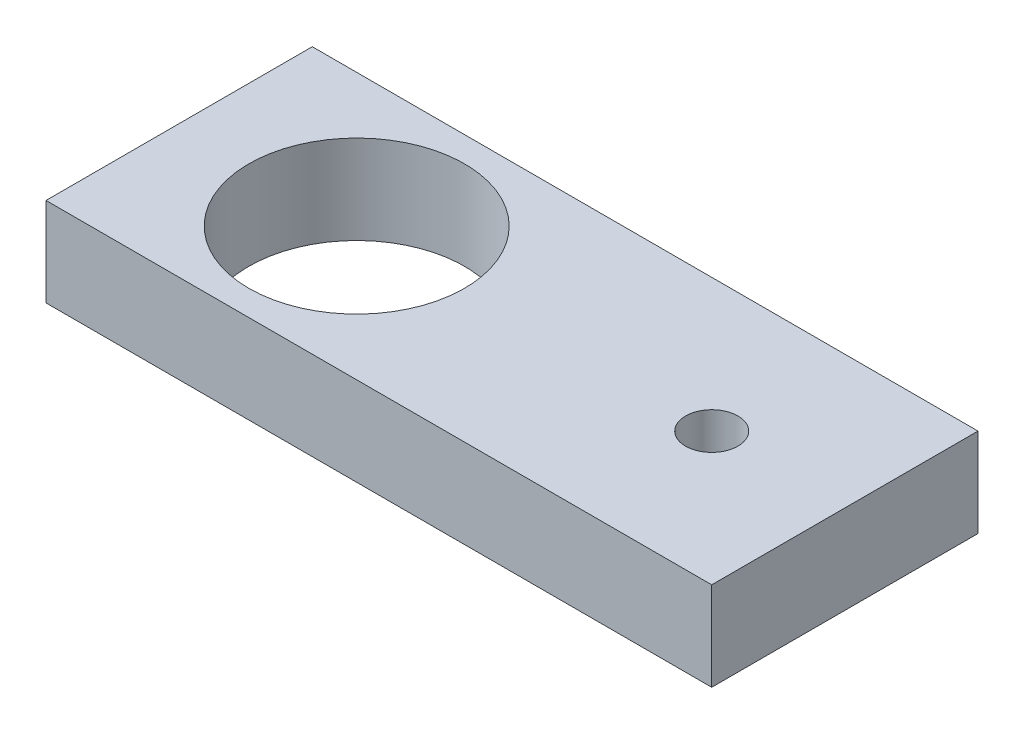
ISO-10303-21;
HEADER;
FILE_DESCRIPTION(('STEP AP214'),'2;1');
FILE_NAME('part.step','',(''),(''),'','','');
FILE_SCHEMA(('AUTOMOTIVE_DESIGN { 1 0 10303 214 1 1 1 1 }'));
ENDSEC;
DATA;
#1=APPLICATION_CONTEXT('core data for automotive mechanical design processes');
#2=APPLICATION_PROTOCOL_DEFINITION('international standard','automotive_design',2000,#1);
#3=PRODUCT_CONTEXT('',#1,'mechanical');
#4=PRODUCT('Part','Part','',(#3));
#5=PRODUCT_RELATED_PRODUCT_CATEGORY('part','',(#4));
#6=PRODUCT_DEFINITION_FORMATION('','',#4);
#7=PRODUCT_DEFINITION_CONTEXT('part definition',#1,'design');
#8=PRODUCT_DEFINITION('design','',#6,#7);
#9=PRODUCT_DEFINITION_SHAPE('','',#8);
#10=(LENGTH_UNIT() NAMED_UNIT(*) SI_UNIT(.MILLI.,.METRE.));
#11=(NAMED_UNIT(*) PLANE_ANGLE_UNIT() SI_UNIT($,.RADIAN.));
#12=(NAMED_UNIT(*) SI_UNIT($,.STERADIAN.) SOLID_ANGLE_UNIT());
#13=UNCERTAINTY_MEASURE_WITH_UNIT(LENGTH_MEASURE(1.E-05),#10,'distance_accuracy_value','');
#14=(GEOMETRIC_REPRESENTATION_CONTEXT(3) GLOBAL_UNCERTAINTY_ASSIGNED_CONTEXT((#13)) GLOBAL_UNIT_ASSIGNED_CONTEXT((#10,
#11,#12)) REPRESENTATION_CONTEXT('',''));
#15=CARTESIAN_POINT('',(0.,0.,0.));
#16=DIRECTION('',(0.,0.,1.));
#17=DIRECTION('',(1.,0.,0.));
#18=AXIS2_PLACEMENT_3D('',#15,#16,#17);
#19=CARTESIAN_POINT('',(0.,2.,0.));
#20=DIRECTION('',(1.,0.,0.));
#21=DIRECTION('',(0.,0.,-1.));
#22=AXIS2_PLACEMENT_3D('',#19,#20,#21);
#23=PLANE('',#22);
#24=DIRECTION('',(0.,0.,1.));
#25=VECTOR('',#24,1.);
#26=CARTESIAN_POINT('',(0.,0.,0.));
#27=LINE('',#26,#25);
#28=CARTESIAN_POINT('',(0.,0.,0.));
#29=VERTEX_POINT('',#28);
#30=CARTESIAN_POINT('',(0.,0.,6.));
#31=VERTEX_POINT('',#30);
#32=EDGE_CURVE('E114',#29,#31,#27,.T.);
#33=ORIENTED_EDGE('',*,*,#32,.T.);
#34=DIRECTION('',(0.,-1.,0.));
#35=VECTOR('',#34,1.);
#36=CARTESIAN_POINT('',(0.,2.,6.));
#37=LINE('',#36,#35);
#38=CARTESIAN_POINT('',(0.,2.,6.));
#39=VERTEX_POINT('',#38);
#40=EDGE_CURVE('E11',#39,#31,#37,.T.);
#41=ORIENTED_EDGE('',*,*,#40,.F.);
#42=DIRECTION('',(0.,0.,1.));
#43=VECTOR('',#42,1.);
#44=CARTESIAN_POINT('',(0.,2.,0.));
#45=LINE('',#44,#43);
#46=CARTESIAN_POINT('',(0.,2.,0.));
#47=VERTEX_POINT('',#46);
#48=EDGE_CURVE('E100',#47,#39,#45,.T.);
#49=ORIENTED_EDGE('',*,*,#48,.F.);
#50=DIRECTION('',(0.,-1.,0.));
#51=VECTOR('',#50,1.);
#52=CARTESIAN_POINT('',(0.,2.,0.));
#53=LINE('',#52,#51);
#54=EDGE_CURVE('E108',#47,#29,#53,.T.);
#55=ORIENTED_EDGE('',*,*,#54,.T.);
#56=EDGE_LOOP('',(#33,#41,#49,#55));
#57=FACE_BOUND('',#56,.T.);
#58=ADVANCED_FACE('F44',(#57),#23,.F.);
#59=CARTESIAN_POINT('',(0.,2.,6.));
#60=DIRECTION('',(0.,0.,-1.));
#61=DIRECTION('',(-1.,0.,0.));
#62=AXIS2_PLACEMENT_3D('',#59,#60,#61);
#63=PLANE('',#62);
#64=DIRECTION('',(1.,0.,0.));
#65=VECTOR('',#64,1.);
#66=CARTESIAN_POINT('',(0.,0.,6.));
#67=LINE('',#66,#65);
#68=CARTESIAN_POINT('',(15.,0.,6.));
#69=VERTEX_POINT('',#68);
#70=EDGE_CURVE('E105',#31,#69,#67,.T.);
#71=ORIENTED_EDGE('',*,*,#70,.T.);
#72=DIRECTION('',(0.,-1.,0.));
#73=VECTOR('',#72,1.);
#74=CARTESIAN_POINT('',(15.,2.,6.));
#75=LINE('',#74,#73);
#76=CARTESIAN_POINT('',(15.,2.,6.));
#77=VERTEX_POINT('',#76);
#78=EDGE_CURVE('E53',#77,#69,#75,.T.);
#79=ORIENTED_EDGE('',*,*,#78,.F.);
#80=DIRECTION('',(1.,0.,0.));
#81=VECTOR('',#80,1.);
#82=CARTESIAN_POINT('',(0.,2.,6.));
#83=LINE('',#82,#81);
#84=EDGE_CURVE('E95',#39,#77,#83,.T.);
#85=ORIENTED_EDGE('',*,*,#84,.F.);
#86=ORIENTED_EDGE('',*,*,#40,.T.);
#87=EDGE_LOOP('',(#71,#79,#85,#86));
#88=FACE_BOUND('',#87,.T.);
#89=ADVANCED_FACE('F101',(#88),#63,.F.);
#90=CARTESIAN_POINT('',(15.,2.,0.));
#91=DIRECTION('',(-1.,0.,0.));
#92=DIRECTION('',(0.,0.,1.));
#93=AXIS2_PLACEMENT_3D('',#90,#91,#92);
#94=PLANE('',#93);
#95=DIRECTION('',(0.,0.,-1.));
#96=VECTOR('',#95,1.);
#97=CARTESIAN_POINT('',(15.,0.,0.));
#98=LINE('',#97,#96);
#99=CARTESIAN_POINT('',(15.,0.,0.));
#100=VERTEX_POINT('',#99);
#101=EDGE_CURVE('E78',#69,#100,#98,.T.);
#102=ORIENTED_EDGE('',*,*,#101,.T.);
#103=DIRECTION('',(0.,-1.,0.));
#104=VECTOR('',#103,1.);
#105=CARTESIAN_POINT('',(15.,2.,0.));
#106=LINE('',#105,#104);
#107=CARTESIAN_POINT('',(15.,2.,0.));
#108=VERTEX_POINT('',#107);
#109=EDGE_CURVE('E102',#108,#100,#106,.T.);
#110=ORIENTED_EDGE('',*,*,#109,.F.);
#111=DIRECTION('',(0.,0.,-1.));
#112=VECTOR('',#111,1.);
#113=CARTESIAN_POINT('',(15.,2.,0.));
#114=LINE('',#113,#112);
#115=EDGE_CURVE('E92',#77,#108,#114,.T.);
#116=ORIENTED_EDGE('',*,*,#115,.F.);
#117=ORIENTED_EDGE('',*,*,#78,.T.);
#118=EDGE_LOOP('',(#102,#110,#116,#117));
#119=FACE_BOUND('',#118,.T.);
#120=ADVANCED_FACE('F104',(#119),#94,.F.);
#121=CARTESIAN_POINT('',(0.,2.,0.));
#122=DIRECTION('',(0.,0.,1.));
#123=DIRECTION('',(1.,0.,0.));
#124=AXIS2_PLACEMENT_3D('',#121,#122,#123);
#125=PLANE('',#124);
#126=DIRECTION('',(-1.,0.,0.));
#127=VECTOR('',#126,1.);
#128=CARTESIAN_POINT('',(0.,0.,0.));
#129=LINE('',#128,#127);
#130=EDGE_CURVE('E84',#100,#29,#129,.T.);
#131=ORIENTED_EDGE('',*,*,#130,.T.);
#132=ORIENTED_EDGE('',*,*,#54,.F.);
#133=DIRECTION('',(-1.,0.,0.));
#134=VECTOR('',#133,1.);
#135=CARTESIAN_POINT('',(0.,2.,0.));
#136=LINE('',#135,#134);
#137=EDGE_CURVE('E65',#108,#47,#136,.T.);
#138=ORIENTED_EDGE('',*,*,#137,.F.);
#139=ORIENTED_EDGE('',*,*,#109,.T.);
#140=EDGE_LOOP('',(#131,#132,#138,#139));
#141=FACE_BOUND('',#140,.T.);
#142=ADVANCED_FACE('F130',(#141),#125,.F.);
#143=CARTESIAN_POINT('',(0.,2.,0.));
#144=DIRECTION('',(0.,1.,0.));
#145=DIRECTION('',(0.,0.,1.));
#146=AXIS2_PLACEMENT_3D('',#143,#144,#145);
#147=PLANE('',#146);
#148=CARTESIAN_POINT('',(4.00000000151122,2.,2.99999818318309));
#149=DIRECTION('',(0.,1.,0.));
#150=DIRECTION('',(0.,0.,1.));
#151=AXIS2_PLACEMENT_3D('',#148,#149,#150);
#152=CIRCLE('',#151,2.43);
#153=CARTESIAN_POINT('',(4.00000000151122,2.,5.42999818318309));
#154=VERTEX_POINT('',#153);
#155=EDGE_CURVE('E142',#154,#154,#152,.T.);
#156=ORIENTED_EDGE('',*,*,#155,.F.);
#157=EDGE_LOOP('',(#156));
#158=FACE_BOUND('',#157,.T.);
#159=CARTESIAN_POINT('',(12.,2.,2.99984268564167));
#160=DIRECTION('',(0.,1.,0.));
#161=DIRECTION('',(0.,0.,1.));
#162=AXIS2_PLACEMENT_3D('',#159,#160,#161);
#163=CIRCLE('',#162,0.590071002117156);
#164=CARTESIAN_POINT('',(12.,2.,3.58991368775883));
#165=VERTEX_POINT('',#164);
#166=EDGE_CURVE('E138',#165,#165,#163,.T.);
#167=ORIENTED_EDGE('',*,*,#166,.F.);
#168=EDGE_LOOP('',(#167));
#169=FACE_BOUND('',#168,.T.);
#170=ORIENTED_EDGE('',*,*,#48,.T.);
#171=ORIENTED_EDGE('',*,*,#84,.T.);
#172=ORIENTED_EDGE('',*,*,#115,.T.);
#173=ORIENTED_EDGE('',*,*,#137,.T.);
#174=EDGE_LOOP('',(#170,#171,#172,#173));
#175=FACE_BOUND('',#174,.T.);
#176=ADVANCED_FACE('F91',(#158,#169,#175),#147,.T.);
#177=CARTESIAN_POINT('',(0.,0.,0.));
#178=DIRECTION('',(0.,1.,0.));
#179=DIRECTION('',(0.,0.,1.));
#180=AXIS2_PLACEMENT_3D('',#177,#178,#179);
#181=PLANE('',#180);
#182=CARTESIAN_POINT('',(4.00000000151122,0.,2.99999818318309));
#183=DIRECTION('',(0.,1.,0.));
#184=DIRECTION('',(0.,0.,1.));
#185=AXIS2_PLACEMENT_3D('',#182,#183,#184);
#186=CIRCLE('',#185,2.43);
#187=CARTESIAN_POINT('',(4.00000000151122,0.,5.42999818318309));
#188=VERTEX_POINT('',#187);
#189=EDGE_CURVE('E120',#188,#188,#186,.T.);
#190=ORIENTED_EDGE('',*,*,#189,.T.);
#191=EDGE_LOOP('',(#190));
#192=FACE_BOUND('',#191,.T.);
#193=CARTESIAN_POINT('',(12.,0.,2.99984268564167));
#194=DIRECTION('',(0.,1.,0.));
#195=DIRECTION('',(0.,0.,1.));
#196=AXIS2_PLACEMENT_3D('',#193,#194,#195);
#197=CIRCLE('',#196,0.590071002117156);
#198=CARTESIAN_POINT('',(12.,0.,3.58991368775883));
#199=VERTEX_POINT('',#198);
#200=EDGE_CURVE('E133',#199,#199,#197,.T.);
#201=ORIENTED_EDGE('',*,*,#200,.T.);
#202=EDGE_LOOP('',(#201));
#203=FACE_BOUND('',#202,.T.);
#204=ORIENTED_EDGE('',*,*,#32,.F.);
#205=ORIENTED_EDGE('',*,*,#130,.F.);
#206=ORIENTED_EDGE('',*,*,#101,.F.);
#207=ORIENTED_EDGE('',*,*,#70,.F.);
#208=EDGE_LOOP('',(#204,#205,#206,#207));
#209=FACE_BOUND('',#208,.T.);
#210=ADVANCED_FACE('F128',(#192,#203,#209),#181,.F.);
#211=CARTESIAN_POINT('',(12.,0.,2.99984268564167));
#212=DIRECTION('',(0.,1.,0.));
#213=DIRECTION('',(0.,0.,1.));
#214=AXIS2_PLACEMENT_3D('',#211,#212,#213);
#215=CYLINDRICAL_SURFACE('',#214,0.590071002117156);
#216=ORIENTED_EDGE('',*,*,#200,.F.);
#217=EDGE_LOOP('',(#216));
#218=FACE_BOUND('',#217,.T.);
#219=ORIENTED_EDGE('',*,*,#166,.T.);
#220=EDGE_LOOP('',(#219));
#221=FACE_BOUND('',#220,.T.);
#222=ADVANCED_FACE('F154',(#218,#221),#215,.F.);
#223=CARTESIAN_POINT('',(4.00000000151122,0.,2.99999818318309));
#224=DIRECTION('',(0.,1.,0.));
#225=DIRECTION('',(0.,0.,1.));
#226=AXIS2_PLACEMENT_3D('',#223,#224,#225);
#227=CYLINDRICAL_SURFACE('',#226,2.43);
#228=ORIENTED_EDGE('',*,*,#189,.F.);
#229=EDGE_LOOP('',(#228));
#230=FACE_BOUND('',#229,.T.);
#231=ORIENTED_EDGE('',*,*,#155,.T.);
#232=EDGE_LOOP('',(#231));
#233=FACE_BOUND('',#232,.T.);
#234=ADVANCED_FACE('F155',(#230,#233),#227,.F.);
#235=CLOSED_SHELL('',(#58,#89,#120,#142,#176,#210,#222,#234));
#236=MANIFOLD_SOLID_BREP('B2',#235);
#237=ADVANCED_BREP_SHAPE_REPRESENTATION('',(#18,#236),#14);
#238=SHAPE_DEFINITION_REPRESENTATION(#9,#237);
ENDSEC;
END-ISO-10303-21;
